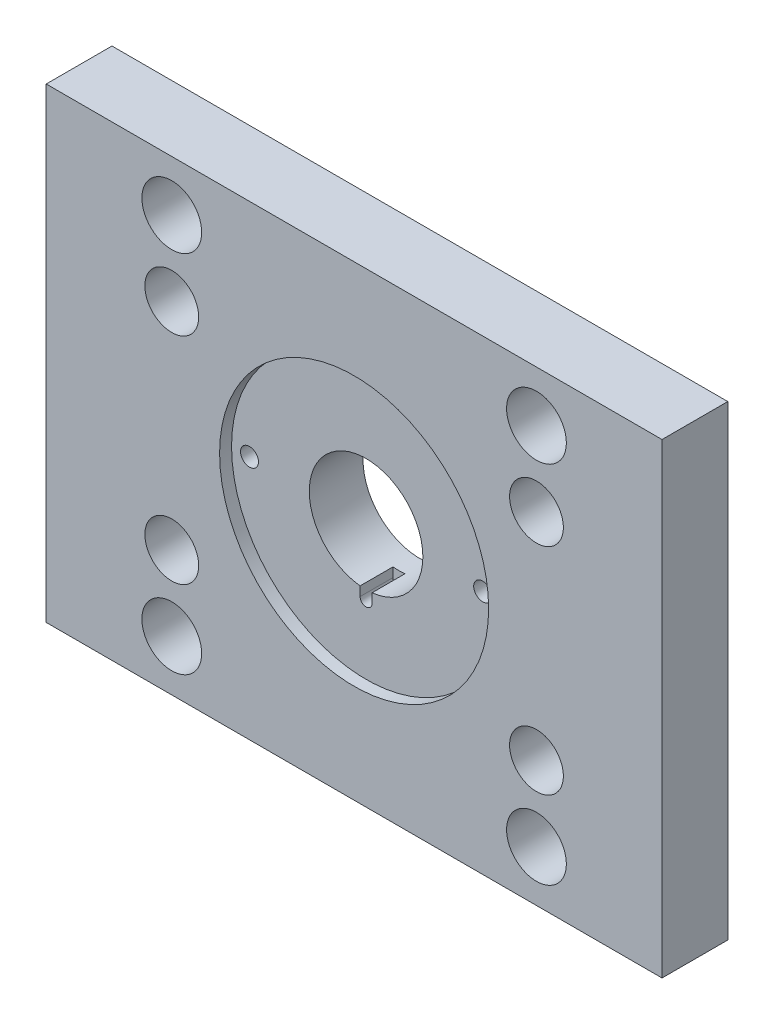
ISO-10303-21;
HEADER;
FILE_DESCRIPTION(('STEP AP214'),'2;1');
FILE_NAME('part.step','',(''),(''),'','','');
FILE_SCHEMA(('AUTOMOTIVE_DESIGN { 1 0 10303 214 1 1 1 1 }'));
ENDSEC;
DATA;
#1=APPLICATION_CONTEXT('core data for automotive mechanical design processes');
#2=APPLICATION_PROTOCOL_DEFINITION('international standard','automotive_design',2000,#1);
#3=PRODUCT_CONTEXT('',#1,'mechanical');
#4=PRODUCT('Part','Part','',(#3));
#5=PRODUCT_RELATED_PRODUCT_CATEGORY('part','',(#4));
#6=PRODUCT_DEFINITION_FORMATION('','',#4);
#7=PRODUCT_DEFINITION_CONTEXT('part definition',#1,'design');
#8=PRODUCT_DEFINITION('design','',#6,#7);
#9=PRODUCT_DEFINITION_SHAPE('','',#8);
#10=(LENGTH_UNIT() NAMED_UNIT(*) SI_UNIT(.MILLI.,.METRE.));
#11=(NAMED_UNIT(*) PLANE_ANGLE_UNIT() SI_UNIT($,.RADIAN.));
#12=(NAMED_UNIT(*) SI_UNIT($,.STERADIAN.) SOLID_ANGLE_UNIT());
#13=UNCERTAINTY_MEASURE_WITH_UNIT(LENGTH_MEASURE(1.E-05),#10,'distance_accuracy_value','');
#14=(GEOMETRIC_REPRESENTATION_CONTEXT(3) GLOBAL_UNCERTAINTY_ASSIGNED_CONTEXT((#13)) GLOBAL_UNIT_ASSIGNED_CONTEXT((#10,
#11,#12)) REPRESENTATION_CONTEXT('',''));
#15=CARTESIAN_POINT('',(0.,0.,0.));
#16=DIRECTION('',(0.,0.,1.));
#17=DIRECTION('',(1.,0.,0.));
#18=AXIS2_PLACEMENT_3D('',#15,#16,#17);
#19=CARTESIAN_POINT('',(0.,0.,0.));
#20=DIRECTION('',(0.,0.,1.));
#21=DIRECTION('',(1.,0.,0.));
#22=AXIS2_PLACEMENT_3D('',#19,#20,#21);
#23=CYLINDRICAL_SURFACE('',#22,19.);
#24=CARTESIAN_POINT('',(0.,0.,18.));
#25=DIRECTION('',(0.,0.,1.));
#26=DIRECTION('',(1.,0.,0.));
#27=AXIS2_PLACEMENT_3D('',#24,#25,#26);
#28=CIRCLE('',#27,19.);
#29=CARTESIAN_POINT('',(-2.,-18.8944436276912,18.));
#30=VERTEX_POINT('',#29);
#31=CARTESIAN_POINT('',(2.,-18.8944436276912,18.));
#32=VERTEX_POINT('',#31);
#33=EDGE_CURVE('E119',#30,#32,#28,.F.);
#34=ORIENTED_EDGE('',*,*,#33,.F.);
#35=DIRECTION('',(0.,0.,1.));
#36=VECTOR('',#35,1.);
#37=CARTESIAN_POINT('',(-2.,-18.8944436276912,0.));
#38=LINE('',#37,#36);
#39=CARTESIAN_POINT('',(-2.,-18.8944436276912,7.));
#40=VERTEX_POINT('',#39);
#41=EDGE_CURVE('E129',#30,#40,#38,.F.);
#42=ORIENTED_EDGE('',*,*,#41,.T.);
#43=CARTESIAN_POINT('',(0.,0.,7.));
#44=DIRECTION('',(0.,0.,-1.));
#45=DIRECTION('',(-1.,0.,0.));
#46=AXIS2_PLACEMENT_3D('',#43,#44,#45);
#47=CIRCLE('',#46,19.);
#48=CARTESIAN_POINT('',(2.,-18.8944436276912,7.));
#49=VERTEX_POINT('',#48);
#50=EDGE_CURVE('E11',#40,#49,#47,.F.);
#51=ORIENTED_EDGE('',*,*,#50,.T.);
#52=DIRECTION('',(0.,0.,1.));
#53=VECTOR('',#52,1.);
#54=CARTESIAN_POINT('',(2.,-18.8944436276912,0.));
#55=LINE('',#54,#53);
#56=EDGE_CURVE('E107',#49,#32,#55,.T.);
#57=ORIENTED_EDGE('',*,*,#56,.T.);
#58=EDGE_LOOP('',(#34,#42,#51,#57));
#59=FACE_BOUND('',#58,.T.);
#60=CARTESIAN_POINT('',(0.,0.,0.));
#61=DIRECTION('',(0.,0.,1.));
#62=DIRECTION('',(1.,0.,0.));
#63=AXIS2_PLACEMENT_3D('',#60,#61,#62);
#64=CIRCLE('',#63,19.);
#65=CARTESIAN_POINT('',(19.,0.,0.));
#66=VERTEX_POINT('',#65);
#67=EDGE_CURVE('E150',#66,#66,#64,.T.);
#68=ORIENTED_EDGE('',*,*,#67,.F.);
#69=EDGE_LOOP('',(#68));
#70=FACE_BOUND('',#69,.T.);
#71=ADVANCED_FACE('F32',(#59,#70),#23,.F.);
#72=CARTESIAN_POINT('',(61.,-36.,0.));
#73=DIRECTION('',(0.,0.,1.));
#74=DIRECTION('',(1.,0.,0.));
#75=AXIS2_PLACEMENT_3D('',#72,#73,#74);
#76=CYLINDRICAL_SURFACE('',#75,5.);
#77=CARTESIAN_POINT('',(61.,-36.,0.));
#78=DIRECTION('',(0.,0.,1.));
#79=DIRECTION('',(1.,0.,0.));
#80=AXIS2_PLACEMENT_3D('',#77,#78,#79);
#81=CIRCLE('',#80,5.);
#82=CARTESIAN_POINT('',(66.,-36.,0.));
#83=VERTEX_POINT('',#82);
#84=EDGE_CURVE('E174',#83,#83,#81,.T.);
#85=ORIENTED_EDGE('',*,*,#84,.F.);
#86=EDGE_LOOP('',(#85));
#87=FACE_BOUND('',#86,.T.);
#88=CARTESIAN_POINT('',(61.,-36.,9.));
#89=DIRECTION('',(0.,0.,1.));
#90=DIRECTION('',(1.,0.,0.));
#91=AXIS2_PLACEMENT_3D('',#88,#89,#90);
#92=CIRCLE('',#91,5.);
#93=CARTESIAN_POINT('',(66.,-36.,9.));
#94=VERTEX_POINT('',#93);
#95=EDGE_CURVE('E159',#94,#94,#92,.F.);
#96=ORIENTED_EDGE('',*,*,#95,.F.);
#97=EDGE_LOOP('',(#96));
#98=FACE_BOUND('',#97,.T.);
#99=ADVANCED_FACE('F273',(#87,#98),#76,.F.);
#100=CARTESIAN_POINT('',(61.,36.,0.));
#101=DIRECTION('',(0.,0.,1.));
#102=DIRECTION('',(1.,0.,0.));
#103=AXIS2_PLACEMENT_3D('',#100,#101,#102);
#104=CYLINDRICAL_SURFACE('',#103,5.);
#105=CARTESIAN_POINT('',(61.,36.,0.));
#106=DIRECTION('',(0.,0.,1.));
#107=DIRECTION('',(1.,0.,0.));
#108=AXIS2_PLACEMENT_3D('',#105,#106,#107);
#109=CIRCLE('',#108,5.);
#110=CARTESIAN_POINT('',(66.,36.,0.));
#111=VERTEX_POINT('',#110);
#112=EDGE_CURVE('E177',#111,#111,#109,.T.);
#113=ORIENTED_EDGE('',*,*,#112,.F.);
#114=EDGE_LOOP('',(#113));
#115=FACE_BOUND('',#114,.T.);
#116=CARTESIAN_POINT('',(61.,36.,9.));
#117=DIRECTION('',(0.,0.,1.));
#118=DIRECTION('',(1.,0.,0.));
#119=AXIS2_PLACEMENT_3D('',#116,#117,#118);
#120=CIRCLE('',#119,5.);
#121=CARTESIAN_POINT('',(66.,36.,9.));
#122=VERTEX_POINT('',#121);
#123=EDGE_CURVE('E166',#122,#122,#120,.F.);
#124=ORIENTED_EDGE('',*,*,#123,.F.);
#125=EDGE_LOOP('',(#124));
#126=FACE_BOUND('',#125,.T.);
#127=ADVANCED_FACE('F278',(#115,#126),#104,.F.);
#128=CARTESIAN_POINT('',(-61.,-36.,0.));
#129=DIRECTION('',(0.,0.,1.));
#130=DIRECTION('',(1.,0.,0.));
#131=AXIS2_PLACEMENT_3D('',#128,#129,#130);
#132=CYLINDRICAL_SURFACE('',#131,5.);
#133=CARTESIAN_POINT('',(-61.,-36.,0.));
#134=DIRECTION('',(0.,0.,1.));
#135=DIRECTION('',(1.,0.,0.));
#136=AXIS2_PLACEMENT_3D('',#133,#134,#135);
#137=CIRCLE('',#136,5.);
#138=CARTESIAN_POINT('',(-56.,-36.,0.));
#139=VERTEX_POINT('',#138);
#140=EDGE_CURVE('E180',#139,#139,#137,.T.);
#141=ORIENTED_EDGE('',*,*,#140,.F.);
#142=EDGE_LOOP('',(#141));
#143=FACE_BOUND('',#142,.T.);
#144=CARTESIAN_POINT('',(-61.,-36.,9.));
#145=DIRECTION('',(0.,0.,1.));
#146=DIRECTION('',(1.,0.,0.));
#147=AXIS2_PLACEMENT_3D('',#144,#145,#146);
#148=CIRCLE('',#147,5.);
#149=CARTESIAN_POINT('',(-56.,-36.,9.));
#150=VERTEX_POINT('',#149);
#151=EDGE_CURVE('E173',#150,#150,#148,.F.);
#152=ORIENTED_EDGE('',*,*,#151,.F.);
#153=EDGE_LOOP('',(#152));
#154=FACE_BOUND('',#153,.T.);
#155=ADVANCED_FACE('F312',(#143,#154),#132,.F.);
#156=CARTESIAN_POINT('',(-61.,36.,0.));
#157=DIRECTION('',(0.,0.,1.));
#158=DIRECTION('',(1.,0.,0.));
#159=AXIS2_PLACEMENT_3D('',#156,#157,#158);
#160=CYLINDRICAL_SURFACE('',#159,5.);
#161=CARTESIAN_POINT('',(-61.,36.,0.));
#162=DIRECTION('',(0.,0.,1.));
#163=DIRECTION('',(1.,0.,0.));
#164=AXIS2_PLACEMENT_3D('',#161,#162,#163);
#165=CIRCLE('',#164,5.);
#166=CARTESIAN_POINT('',(-56.,36.,0.));
#167=VERTEX_POINT('',#166);
#168=EDGE_CURVE('E190',#167,#167,#165,.T.);
#169=ORIENTED_EDGE('',*,*,#168,.F.);
#170=EDGE_LOOP('',(#169));
#171=FACE_BOUND('',#170,.T.);
#172=CARTESIAN_POINT('',(-61.,36.,9.));
#173=DIRECTION('',(0.,0.,1.));
#174=DIRECTION('',(1.,0.,0.));
#175=AXIS2_PLACEMENT_3D('',#172,#173,#174);
#176=CIRCLE('',#175,5.);
#177=CARTESIAN_POINT('',(-56.,36.,9.));
#178=VERTEX_POINT('',#177);
#179=EDGE_CURVE('E189',#178,#178,#176,.F.);
#180=ORIENTED_EDGE('',*,*,#179,.F.);
#181=EDGE_LOOP('',(#180));
#182=FACE_BOUND('',#181,.T.);
#183=ADVANCED_FACE('F316',(#171,#182),#160,.F.);
#184=CARTESIAN_POINT('',(-103.,78.,22.));
#185=DIRECTION('',(1.,0.,0.));
#186=DIRECTION('',(0.,1.,0.));
#187=AXIS2_PLACEMENT_3D('',#184,#185,#186);
#188=PLANE('',#187);
#189=DIRECTION('',(0.,-1.,0.));
#190=VECTOR('',#189,1.);
#191=CARTESIAN_POINT('',(-103.,78.,0.));
#192=LINE('',#191,#190);
#193=CARTESIAN_POINT('',(-103.,78.,0.));
#194=VERTEX_POINT('',#193);
#195=CARTESIAN_POINT('',(-103.,-78.,0.));
#196=VERTEX_POINT('',#195);
#197=EDGE_CURVE('E205',#194,#196,#192,.T.);
#198=ORIENTED_EDGE('',*,*,#197,.T.);
#199=DIRECTION('',(0.,0.,-1.));
#200=VECTOR('',#199,1.);
#201=CARTESIAN_POINT('',(-103.,-78.,22.));
#202=LINE('',#201,#200);
#203=CARTESIAN_POINT('',(-103.,-78.,22.));
#204=VERTEX_POINT('',#203);
#205=EDGE_CURVE('E230',#204,#196,#202,.T.);
#206=ORIENTED_EDGE('',*,*,#205,.F.);
#207=DIRECTION('',(0.,-1.,0.));
#208=VECTOR('',#207,1.);
#209=CARTESIAN_POINT('',(-103.,78.,22.));
#210=LINE('',#209,#208);
#211=CARTESIAN_POINT('',(-103.,78.,22.));
#212=VERTEX_POINT('',#211);
#213=EDGE_CURVE('E214',#212,#204,#210,.T.);
#214=ORIENTED_EDGE('',*,*,#213,.F.);
#215=DIRECTION('',(0.,0.,-1.));
#216=VECTOR('',#215,1.);
#217=CARTESIAN_POINT('',(-103.,78.,22.));
#218=LINE('',#217,#216);
#219=EDGE_CURVE('E221',#212,#194,#218,.T.);
#220=ORIENTED_EDGE('',*,*,#219,.T.);
#221=EDGE_LOOP('',(#198,#206,#214,#220));
#222=FACE_BOUND('',#221,.T.);
#223=ADVANCED_FACE('F327',(#222),#188,.F.);
#224=CARTESIAN_POINT('',(-103.,-78.,22.));
#225=DIRECTION('',(0.,1.,0.));
#226=DIRECTION('',(0.,0.,1.));
#227=AXIS2_PLACEMENT_3D('',#224,#225,#226);
#228=PLANE('',#227);
#229=DIRECTION('',(1.,0.,0.));
#230=VECTOR('',#229,1.);
#231=CARTESIAN_POINT('',(-103.,-78.,0.));
#232=LINE('',#231,#230);
#233=CARTESIAN_POINT('',(103.,-78.,0.));
#234=VERTEX_POINT('',#233);
#235=EDGE_CURVE('E208',#196,#234,#232,.T.);
#236=ORIENTED_EDGE('',*,*,#235,.T.);
#237=DIRECTION('',(0.,0.,-1.));
#238=VECTOR('',#237,1.);
#239=CARTESIAN_POINT('',(103.,-78.,22.));
#240=LINE('',#239,#238);
#241=CARTESIAN_POINT('',(103.,-78.,22.));
#242=VERTEX_POINT('',#241);
#243=EDGE_CURVE('E227',#242,#234,#240,.T.);
#244=ORIENTED_EDGE('',*,*,#243,.F.);
#245=DIRECTION('',(1.,0.,0.));
#246=VECTOR('',#245,1.);
#247=CARTESIAN_POINT('',(-103.,-78.,22.));
#248=LINE('',#247,#246);
#249=EDGE_CURVE('E216',#204,#242,#248,.T.);
#250=ORIENTED_EDGE('',*,*,#249,.F.);
#251=ORIENTED_EDGE('',*,*,#205,.T.);
#252=EDGE_LOOP('',(#236,#244,#250,#251));
#253=FACE_BOUND('',#252,.T.);
#254=ADVANCED_FACE('F353',(#253),#228,.F.);
#255=CARTESIAN_POINT('',(103.,78.,22.));
#256=DIRECTION('',(-1.,0.,0.));
#257=DIRECTION('',(0.,-1.,0.));
#258=AXIS2_PLACEMENT_3D('',#255,#256,#257);
#259=PLANE('',#258);
#260=DIRECTION('',(0.,1.,0.));
#261=VECTOR('',#260,1.);
#262=CARTESIAN_POINT('',(103.,78.,0.));
#263=LINE('',#262,#261);
#264=CARTESIAN_POINT('',(103.,78.,0.));
#265=VERTEX_POINT('',#264);
#266=EDGE_CURVE('E210',#234,#265,#263,.T.);
#267=ORIENTED_EDGE('',*,*,#266,.T.);
#268=DIRECTION('',(0.,0.,-1.));
#269=VECTOR('',#268,1.);
#270=CARTESIAN_POINT('',(103.,78.,22.));
#271=LINE('',#270,#269);
#272=CARTESIAN_POINT('',(103.,78.,22.));
#273=VERTEX_POINT('',#272);
#274=EDGE_CURVE('E224',#273,#265,#271,.T.);
#275=ORIENTED_EDGE('',*,*,#274,.F.);
#276=DIRECTION('',(0.,1.,0.));
#277=VECTOR('',#276,1.);
#278=CARTESIAN_POINT('',(103.,78.,22.));
#279=LINE('',#278,#277);
#280=EDGE_CURVE('E218',#242,#273,#279,.T.);
#281=ORIENTED_EDGE('',*,*,#280,.F.);
#282=ORIENTED_EDGE('',*,*,#243,.T.);
#283=EDGE_LOOP('',(#267,#275,#281,#282));
#284=FACE_BOUND('',#283,.T.);
#285=ADVANCED_FACE('F349',(#284),#259,.F.);
#286=CARTESIAN_POINT('',(-103.,78.,22.));
#287=DIRECTION('',(0.,-1.,0.));
#288=DIRECTION('',(0.,0.,-1.));
#289=AXIS2_PLACEMENT_3D('',#286,#287,#288);
#290=PLANE('',#289);
#291=DIRECTION('',(-1.,0.,0.));
#292=VECTOR('',#291,1.);
#293=CARTESIAN_POINT('',(-103.,78.,0.));
#294=LINE('',#293,#292);
#295=EDGE_CURVE('E212',#265,#194,#294,.T.);
#296=ORIENTED_EDGE('',*,*,#295,.T.);
#297=ORIENTED_EDGE('',*,*,#219,.F.);
#298=DIRECTION('',(-1.,0.,0.));
#299=VECTOR('',#298,1.);
#300=CARTESIAN_POINT('',(-103.,78.,22.));
#301=LINE('',#300,#299);
#302=EDGE_CURVE('E55',#273,#212,#301,.T.);
#303=ORIENTED_EDGE('',*,*,#302,.F.);
#304=ORIENTED_EDGE('',*,*,#274,.T.);
#305=EDGE_LOOP('',(#296,#297,#303,#304));
#306=FACE_BOUND('',#305,.T.);
#307=ADVANCED_FACE('F345',(#306),#290,.F.);
#308=CARTESIAN_POINT('',(-103.,-78.,22.));
#309=DIRECTION('',(0.,0.,1.));
#310=DIRECTION('',(1.,0.,0.));
#311=AXIS2_PLACEMENT_3D('',#308,#309,#310);
#312=PLANE('',#311);
#313=CARTESIAN_POINT('',(0.,0.,22.));
#314=DIRECTION('',(0.,0.,1.));
#315=DIRECTION('',(1.,0.,0.));
#316=AXIS2_PLACEMENT_3D('',#313,#314,#315);
#317=CIRCLE('',#316,45.);
#318=CARTESIAN_POINT('',(45.,0.,22.));
#319=VERTEX_POINT('',#318);
#320=EDGE_CURVE('E144',#319,#319,#317,.T.);
#321=ORIENTED_EDGE('',*,*,#320,.F.);
#322=EDGE_LOOP('',(#321));
#323=FACE_BOUND('',#322,.T.);
#324=CARTESIAN_POINT('',(61.,-36.,22.));
#325=DIRECTION('',(0.,0.,1.));
#326=DIRECTION('',(1.,0.,0.));
#327=AXIS2_PLACEMENT_3D('',#324,#325,#326);
#328=CIRCLE('',#327,9.);
#329=CARTESIAN_POINT('',(70.,-36.,22.));
#330=VERTEX_POINT('',#329);
#331=EDGE_CURVE('E153',#330,#330,#328,.T.);
#332=ORIENTED_EDGE('',*,*,#331,.F.);
#333=EDGE_LOOP('',(#332));
#334=FACE_BOUND('',#333,.T.);
#335=CARTESIAN_POINT('',(61.,36.,22.));
#336=DIRECTION('',(0.,0.,1.));
#337=DIRECTION('',(1.,0.,0.));
#338=AXIS2_PLACEMENT_3D('',#335,#336,#337);
#339=CIRCLE('',#338,9.);
#340=CARTESIAN_POINT('',(70.,36.,22.));
#341=VERTEX_POINT('',#340);
#342=EDGE_CURVE('E160',#341,#341,#339,.T.);
#343=ORIENTED_EDGE('',*,*,#342,.F.);
#344=EDGE_LOOP('',(#343));
#345=FACE_BOUND('',#344,.T.);
#346=CARTESIAN_POINT('',(-61.,-36.,22.));
#347=DIRECTION('',(0.,0.,1.));
#348=DIRECTION('',(1.,0.,0.));
#349=AXIS2_PLACEMENT_3D('',#346,#347,#348);
#350=CIRCLE('',#349,9.);
#351=CARTESIAN_POINT('',(-52.,-36.,22.));
#352=VERTEX_POINT('',#351);
#353=EDGE_CURVE('E167',#352,#352,#350,.T.);
#354=ORIENTED_EDGE('',*,*,#353,.F.);
#355=EDGE_LOOP('',(#354));
#356=FACE_BOUND('',#355,.T.);
#357=CARTESIAN_POINT('',(-61.,36.,22.));
#358=DIRECTION('',(0.,0.,1.));
#359=DIRECTION('',(1.,0.,0.));
#360=AXIS2_PLACEMENT_3D('',#357,#358,#359);
#361=CIRCLE('',#360,9.);
#362=CARTESIAN_POINT('',(-52.,36.,22.));
#363=VERTEX_POINT('',#362);
#364=EDGE_CURVE('E183',#363,#363,#361,.T.);
#365=ORIENTED_EDGE('',*,*,#364,.F.);
#366=EDGE_LOOP('',(#365));
#367=FACE_BOUND('',#366,.T.);
#368=CARTESIAN_POINT('',(61.,61.,22.));
#369=DIRECTION('',(0.,0.,1.));
#370=DIRECTION('',(1.,0.,0.));
#371=AXIS2_PLACEMENT_3D('',#368,#369,#370);
#372=CIRCLE('',#371,10.);
#373=CARTESIAN_POINT('',(71.,61.,22.));
#374=VERTEX_POINT('',#373);
#375=EDGE_CURVE('E196',#374,#374,#372,.T.);
#376=ORIENTED_EDGE('',*,*,#375,.F.);
#377=EDGE_LOOP('',(#376));
#378=FACE_BOUND('',#377,.T.);
#379=CARTESIAN_POINT('',(-61.,61.,22.));
#380=DIRECTION('',(0.,0.,1.));
#381=DIRECTION('',(1.,0.,0.));
#382=AXIS2_PLACEMENT_3D('',#379,#380,#381);
#383=CIRCLE('',#382,10.);
#384=CARTESIAN_POINT('',(-51.,61.,22.));
#385=VERTEX_POINT('',#384);
#386=EDGE_CURVE('E199',#385,#385,#383,.T.);
#387=ORIENTED_EDGE('',*,*,#386,.F.);
#388=EDGE_LOOP('',(#387));
#389=FACE_BOUND('',#388,.T.);
#390=ORIENTED_EDGE('',*,*,#213,.T.);
#391=ORIENTED_EDGE('',*,*,#249,.T.);
#392=ORIENTED_EDGE('',*,*,#280,.T.);
#393=ORIENTED_EDGE('',*,*,#302,.T.);
#394=EDGE_LOOP('',(#390,#391,#392,#393));
#395=FACE_BOUND('',#394,.T.);
#396=CARTESIAN_POINT('',(-61.,-61.,22.));
#397=DIRECTION('',(0.,0.,1.));
#398=DIRECTION('',(1.,0.,0.));
#399=AXIS2_PLACEMENT_3D('',#396,#397,#398);
#400=CIRCLE('',#399,10.);
#401=CARTESIAN_POINT('',(-51.,-61.,22.));
#402=VERTEX_POINT('',#401);
#403=EDGE_CURVE('E236',#402,#402,#400,.T.);
#404=ORIENTED_EDGE('',*,*,#403,.F.);
#405=EDGE_LOOP('',(#404));
#406=FACE_BOUND('',#405,.T.);
#407=CARTESIAN_POINT('',(61.,-61.,22.));
#408=DIRECTION('',(0.,0.,1.));
#409=DIRECTION('',(1.,0.,0.));
#410=AXIS2_PLACEMENT_3D('',#407,#408,#409);
#411=CIRCLE('',#410,10.);
#412=CARTESIAN_POINT('',(71.,-61.,22.));
#413=VERTEX_POINT('',#412);
#414=EDGE_CURVE('E242',#413,#413,#411,.T.);
#415=ORIENTED_EDGE('',*,*,#414,.F.);
#416=EDGE_LOOP('',(#415));
#417=FACE_BOUND('',#416,.T.);
#418=ADVANCED_FACE('F341',(#323,#334,#345,#356,#367,#378,#389,#395,#406,#417),#312,.T.);
#419=CARTESIAN_POINT('',(-103.,-78.,0.));
#420=DIRECTION('',(0.,0.,1.));
#421=DIRECTION('',(1.,0.,0.));
#422=AXIS2_PLACEMENT_3D('',#419,#420,#421);
#423=PLANE('',#422);
#424=CARTESIAN_POINT('',(39.,0.,0.));
#425=DIRECTION('',(0.,0.,1.));
#426=DIRECTION('',(1.,0.,0.));
#427=AXIS2_PLACEMENT_3D('',#424,#425,#426);
#428=CIRCLE('',#427,3.);
#429=CARTESIAN_POINT('',(42.,0.,0.));
#430=VERTEX_POINT('',#429);
#431=EDGE_CURVE('E135',#430,#430,#428,.T.);
#432=ORIENTED_EDGE('',*,*,#431,.T.);
#433=EDGE_LOOP('',(#432));
#434=FACE_BOUND('',#433,.T.);
#435=CARTESIAN_POINT('',(-39.,0.,0.));
#436=DIRECTION('',(0.,0.,1.));
#437=DIRECTION('',(1.,0.,0.));
#438=AXIS2_PLACEMENT_3D('',#435,#436,#437);
#439=CIRCLE('',#438,3.);
#440=CARTESIAN_POINT('',(-36.,0.,0.));
#441=VERTEX_POINT('',#440);
#442=EDGE_CURVE('E141',#441,#441,#439,.T.);
#443=ORIENTED_EDGE('',*,*,#442,.T.);
#444=EDGE_LOOP('',(#443));
#445=FACE_BOUND('',#444,.T.);
#446=ORIENTED_EDGE('',*,*,#67,.T.);
#447=EDGE_LOOP('',(#446));
#448=FACE_BOUND('',#447,.T.);
#449=ORIENTED_EDGE('',*,*,#84,.T.);
#450=EDGE_LOOP('',(#449));
#451=FACE_BOUND('',#450,.T.);
#452=ORIENTED_EDGE('',*,*,#112,.T.);
#453=EDGE_LOOP('',(#452));
#454=FACE_BOUND('',#453,.T.);
#455=ORIENTED_EDGE('',*,*,#140,.T.);
#456=EDGE_LOOP('',(#455));
#457=FACE_BOUND('',#456,.T.);
#458=ORIENTED_EDGE('',*,*,#168,.T.);
#459=EDGE_LOOP('',(#458));
#460=FACE_BOUND('',#459,.T.);
#461=CARTESIAN_POINT('',(61.,61.,0.));
#462=DIRECTION('',(0.,0.,1.));
#463=DIRECTION('',(1.,0.,0.));
#464=AXIS2_PLACEMENT_3D('',#461,#462,#463);
#465=CIRCLE('',#464,10.);
#466=CARTESIAN_POINT('',(71.,61.,0.));
#467=VERTEX_POINT('',#466);
#468=EDGE_CURVE('E193',#467,#467,#465,.T.);
#469=ORIENTED_EDGE('',*,*,#468,.T.);
#470=EDGE_LOOP('',(#469));
#471=FACE_BOUND('',#470,.T.);
#472=CARTESIAN_POINT('',(-61.,61.,0.));
#473=DIRECTION('',(0.,0.,1.));
#474=DIRECTION('',(1.,0.,0.));
#475=AXIS2_PLACEMENT_3D('',#472,#473,#474);
#476=CIRCLE('',#475,10.);
#477=CARTESIAN_POINT('',(-51.,61.,0.));
#478=VERTEX_POINT('',#477);
#479=EDGE_CURVE('E202',#478,#478,#476,.T.);
#480=ORIENTED_EDGE('',*,*,#479,.T.);
#481=EDGE_LOOP('',(#480));
#482=FACE_BOUND('',#481,.T.);
#483=ORIENTED_EDGE('',*,*,#197,.F.);
#484=ORIENTED_EDGE('',*,*,#295,.F.);
#485=ORIENTED_EDGE('',*,*,#266,.F.);
#486=ORIENTED_EDGE('',*,*,#235,.F.);
#487=EDGE_LOOP('',(#483,#484,#485,#486));
#488=FACE_BOUND('',#487,.T.);
#489=CARTESIAN_POINT('',(-61.,-61.,0.));
#490=DIRECTION('',(0.,0.,1.));
#491=DIRECTION('',(1.,0.,0.));
#492=AXIS2_PLACEMENT_3D('',#489,#490,#491);
#493=CIRCLE('',#492,10.);
#494=CARTESIAN_POINT('',(-51.,-61.,0.));
#495=VERTEX_POINT('',#494);
#496=EDGE_CURVE('E233',#495,#495,#493,.T.);
#497=ORIENTED_EDGE('',*,*,#496,.T.);
#498=EDGE_LOOP('',(#497));
#499=FACE_BOUND('',#498,.T.);
#500=CARTESIAN_POINT('',(61.,-61.,0.));
#501=DIRECTION('',(0.,0.,1.));
#502=DIRECTION('',(1.,0.,0.));
#503=AXIS2_PLACEMENT_3D('',#500,#501,#502);
#504=CIRCLE('',#503,10.);
#505=CARTESIAN_POINT('',(71.,-61.,0.));
#506=VERTEX_POINT('',#505);
#507=EDGE_CURVE('E239',#506,#506,#504,.T.);
#508=ORIENTED_EDGE('',*,*,#507,.T.);
#509=EDGE_LOOP('',(#508));
#510=FACE_BOUND('',#509,.T.);
#511=ADVANCED_FACE('F337',(#434,#445,#448,#451,#454,#457,#460,#471,#482,#488,#499,#510),#423,.F.);
#512=CARTESIAN_POINT('',(-61.,61.,0.));
#513=DIRECTION('',(0.,0.,1.));
#514=DIRECTION('',(1.,0.,0.));
#515=AXIS2_PLACEMENT_3D('',#512,#513,#514);
#516=CYLINDRICAL_SURFACE('',#515,10.);
#517=ORIENTED_EDGE('',*,*,#479,.F.);
#518=EDGE_LOOP('',(#517));
#519=FACE_BOUND('',#518,.T.);
#520=ORIENTED_EDGE('',*,*,#386,.T.);
#521=EDGE_LOOP('',(#520));
#522=FACE_BOUND('',#521,.T.);
#523=ADVANCED_FACE('F333',(#519,#522),#516,.F.);
#524=CARTESIAN_POINT('',(61.,61.,0.));
#525=DIRECTION('',(0.,0.,1.));
#526=DIRECTION('',(1.,0.,0.));
#527=AXIS2_PLACEMENT_3D('',#524,#525,#526);
#528=CYLINDRICAL_SURFACE('',#527,10.);
#529=ORIENTED_EDGE('',*,*,#468,.F.);
#530=EDGE_LOOP('',(#529));
#531=FACE_BOUND('',#530,.T.);
#532=ORIENTED_EDGE('',*,*,#375,.T.);
#533=EDGE_LOOP('',(#532));
#534=FACE_BOUND('',#533,.T.);
#535=ADVANCED_FACE('F329',(#531,#534),#528,.F.);
#536=CARTESIAN_POINT('',(-61.,-61.,0.));
#537=DIRECTION('',(0.,0.,1.));
#538=DIRECTION('',(1.,0.,0.));
#539=AXIS2_PLACEMENT_3D('',#536,#537,#538);
#540=CYLINDRICAL_SURFACE('',#539,10.);
#541=ORIENTED_EDGE('',*,*,#496,.F.);
#542=EDGE_LOOP('',(#541));
#543=FACE_BOUND('',#542,.T.);
#544=ORIENTED_EDGE('',*,*,#403,.T.);
#545=EDGE_LOOP('',(#544));
#546=FACE_BOUND('',#545,.T.);
#547=ADVANCED_FACE('F332',(#543,#546),#540,.F.);
#548=CARTESIAN_POINT('',(61.,-61.,0.));
#549=DIRECTION('',(0.,0.,1.));
#550=DIRECTION('',(1.,0.,0.));
#551=AXIS2_PLACEMENT_3D('',#548,#549,#550);
#552=CYLINDRICAL_SURFACE('',#551,10.);
#553=ORIENTED_EDGE('',*,*,#507,.F.);
#554=EDGE_LOOP('',(#553));
#555=FACE_BOUND('',#554,.T.);
#556=ORIENTED_EDGE('',*,*,#414,.T.);
#557=EDGE_LOOP('',(#556));
#558=FACE_BOUND('',#557,.T.);
#559=ADVANCED_FACE('F34',(#555,#558),#552,.F.);
#560=CARTESIAN_POINT('',(-61.,36.,9.));
#561=DIRECTION('',(0.,0.,1.));
#562=DIRECTION('',(1.,0.,0.));
#563=AXIS2_PLACEMENT_3D('',#560,#561,#562);
#564=PLANE('',#563);
#565=CARTESIAN_POINT('',(-61.,36.,9.));
#566=DIRECTION('',(0.,0.,1.));
#567=DIRECTION('',(1.,0.,0.));
#568=AXIS2_PLACEMENT_3D('',#565,#566,#567);
#569=CIRCLE('',#568,9.);
#570=CARTESIAN_POINT('',(-52.,36.,9.));
#571=VERTEX_POINT('',#570);
#572=EDGE_CURVE('E186',#571,#571,#569,.T.);
#573=ORIENTED_EDGE('',*,*,#572,.T.);
#574=EDGE_LOOP('',(#573));
#575=FACE_BOUND('',#574,.T.);
#576=ORIENTED_EDGE('',*,*,#179,.T.);
#577=EDGE_LOOP('',(#576));
#578=FACE_BOUND('',#577,.T.);
#579=ADVANCED_FACE('F318',(#575,#578),#564,.T.);
#580=CARTESIAN_POINT('',(-61.,36.,9.));
#581=DIRECTION('',(0.,0.,1.));
#582=DIRECTION('',(1.,0.,0.));
#583=AXIS2_PLACEMENT_3D('',#580,#581,#582);
#584=CYLINDRICAL_SURFACE('',#583,9.);
#585=CARTESIAN_POINT('',(-52.,36.,9.));
#586=CARTESIAN_POINT('',(-52.,36.,9.13541666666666));
#587=CARTESIAN_POINT('',(-52.,36.,9.27083333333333));
#588=CARTESIAN_POINT('',(-52.,36.,9.54166666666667));
#589=CARTESIAN_POINT('',(-52.,36.,9.67708333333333));
#590=CARTESIAN_POINT('',(-52.,36.,9.94791666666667));
#591=CARTESIAN_POINT('',(-52.,36.,10.0833333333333));
#592=CARTESIAN_POINT('',(-52.,36.,10.3541666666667));
#593=CARTESIAN_POINT('',(-52.,36.,10.4895833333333));
#594=CARTESIAN_POINT('',(-52.,36.,10.7604166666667));
#595=CARTESIAN_POINT('',(-52.,36.,10.8958333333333));
#596=CARTESIAN_POINT('',(-52.,36.,11.1666666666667));
#597=CARTESIAN_POINT('',(-52.,36.,11.3020833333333));
#598=CARTESIAN_POINT('',(-52.,36.,11.5729166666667));
#599=CARTESIAN_POINT('',(-52.,36.,11.7083333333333));
#600=CARTESIAN_POINT('',(-52.,36.,11.9791666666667));
#601=CARTESIAN_POINT('',(-52.,36.,12.1145833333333));
#602=CARTESIAN_POINT('',(-52.,36.,12.3854166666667));
#603=CARTESIAN_POINT('',(-52.,36.,12.5208333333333));
#604=CARTESIAN_POINT('',(-52.,36.,12.7916666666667));
#605=CARTESIAN_POINT('',(-52.,36.,12.9270833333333));
#606=CARTESIAN_POINT('',(-52.,36.,13.1979166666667));
#607=CARTESIAN_POINT('',(-52.,36.,13.3333333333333));
#608=CARTESIAN_POINT('',(-52.,36.,13.6041666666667));
#609=CARTESIAN_POINT('',(-52.,36.,13.7395833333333));
#610=CARTESIAN_POINT('',(-52.,36.,14.0104166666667));
#611=CARTESIAN_POINT('',(-52.,36.,14.1458333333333));
#612=CARTESIAN_POINT('',(-52.,36.,14.4166666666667));
#613=CARTESIAN_POINT('',(-52.,36.,14.5520833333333));
#614=CARTESIAN_POINT('',(-52.,36.,14.8229166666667));
#615=CARTESIAN_POINT('',(-52.,36.,14.9583333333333));
#616=CARTESIAN_POINT('',(-52.,36.,15.2291666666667));
#617=CARTESIAN_POINT('',(-52.,36.,15.3645833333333));
#618=CARTESIAN_POINT('',(-52.,36.,15.6354166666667));
#619=CARTESIAN_POINT('',(-52.,36.,15.7708333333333));
#620=CARTESIAN_POINT('',(-52.,36.,16.0416666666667));
#621=CARTESIAN_POINT('',(-52.,36.,16.1770833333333));
#622=CARTESIAN_POINT('',(-52.,36.,16.4479166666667));
#623=CARTESIAN_POINT('',(-52.,36.,16.5833333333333));
#624=CARTESIAN_POINT('',(-52.,36.,16.8541666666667));
#625=CARTESIAN_POINT('',(-52.,36.,16.9895833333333));
#626=CARTESIAN_POINT('',(-52.,36.,17.2604166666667));
#627=CARTESIAN_POINT('',(-52.,36.,17.3958333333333));
#628=CARTESIAN_POINT('',(-52.,36.,17.6666666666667));
#629=CARTESIAN_POINT('',(-52.,36.,17.8020833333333));
#630=CARTESIAN_POINT('',(-52.,36.,18.0729166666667));
#631=CARTESIAN_POINT('',(-52.,36.,18.2083333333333));
#632=CARTESIAN_POINT('',(-52.,36.,18.4791666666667));
#633=CARTESIAN_POINT('',(-52.,36.,18.6145833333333));
#634=CARTESIAN_POINT('',(-52.,36.,18.8854166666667));
#635=CARTESIAN_POINT('',(-52.,36.,19.0208333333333));
#636=CARTESIAN_POINT('',(-52.,36.,19.2916666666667));
#637=CARTESIAN_POINT('',(-52.,36.,19.4270833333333));
#638=CARTESIAN_POINT('',(-52.,36.,19.6979166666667));
#639=CARTESIAN_POINT('',(-52.,36.,19.8333333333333));
#640=CARTESIAN_POINT('',(-52.,36.,20.1041666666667));
#641=CARTESIAN_POINT('',(-52.,36.,20.2395833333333));
#642=CARTESIAN_POINT('',(-52.,36.,20.5104166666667));
#643=CARTESIAN_POINT('',(-52.,36.,20.6458333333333));
#644=CARTESIAN_POINT('',(-52.,36.,20.9166666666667));
#645=CARTESIAN_POINT('',(-52.,36.,21.0520833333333));
#646=CARTESIAN_POINT('',(-52.,36.,21.3229166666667));
#647=CARTESIAN_POINT('',(-52.,36.,21.4583333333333));
#648=CARTESIAN_POINT('',(-52.,36.,21.7291666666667));
#649=CARTESIAN_POINT('',(-52.,36.,21.8645833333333));
#650=CARTESIAN_POINT('',(-52.,36.,22.));
#651=B_SPLINE_CURVE_WITH_KNOTS('',3,(#585,#586,#587,#588,#589,#590,#591,#592,#593,#594,#595,
#596,#597,#598,#599,#600,#601,#602,#603,#604,#605,#606,#607,#608,#609,#610,#611,#612,#613,#614,
#615,#616,#617,#618,#619,#620,#621,#622,#623,#624,#625,#626,#627,#628,#629,#630,#631,#632,#633,
#634,#635,#636,#637,#638,#639,#640,#641,#642,#643,#644,#645,#646,#647,#648,#649,#650),
.UNSPECIFIED.,.F.,.F.,(4,2,2,2,2,2,2,2,2,2,2,2,2,2,2,2,2,2,2,2,2,2,2,2,2,2,2,2,2,2,2,2,4),(0.,
0.406249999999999,0.812499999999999,1.21875,1.625,2.03125,2.4375,2.84375,3.25,3.65625,4.0625,
4.46875,4.875,5.28125,5.6875,6.09375,6.5,6.90625,7.3125,7.71875,8.12499999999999,8.53125,8.9375,
9.34375,9.75,10.15625,10.5625,10.96875,11.375,11.78125,12.1875,12.59375,13.),.UNSPECIFIED.);
#652=EDGE_CURVE('BSEAM305',#571,#363,#651,.T.);
#653=ORIENTED_EDGE('',*,*,#572,.F.);
#654=ORIENTED_EDGE('',*,*,#364,.T.);
#655=ORIENTED_EDGE('',*,*,#652,.T.);
#656=ORIENTED_EDGE('',*,*,#652,.F.);
#657=EDGE_LOOP('',(#653,#655,#654,#656));
#658=FACE_BOUND('',#657,.T.);
#659=ADVANCED_FACE('F305',(#658),#584,.F.);
#660=CARTESIAN_POINT('',(-61.,-36.,9.));
#661=DIRECTION('',(0.,0.,1.));
#662=DIRECTION('',(1.,0.,0.));
#663=AXIS2_PLACEMENT_3D('',#660,#661,#662);
#664=PLANE('',#663);
#665=CARTESIAN_POINT('',(-61.,-36.,9.));
#666=DIRECTION('',(0.,0.,1.));
#667=DIRECTION('',(1.,0.,0.));
#668=AXIS2_PLACEMENT_3D('',#665,#666,#667);
#669=CIRCLE('',#668,9.);
#670=CARTESIAN_POINT('',(-52.,-36.,9.));
#671=VERTEX_POINT('',#670);
#672=EDGE_CURVE('E170',#671,#671,#669,.T.);
#673=ORIENTED_EDGE('',*,*,#672,.T.);
#674=EDGE_LOOP('',(#673));
#675=FACE_BOUND('',#674,.T.);
#676=ORIENTED_EDGE('',*,*,#151,.T.);
#677=EDGE_LOOP('',(#676));
#678=FACE_BOUND('',#677,.T.);
#679=ADVANCED_FACE('F302',(#675,#678),#664,.T.);
#680=CARTESIAN_POINT('',(-61.,-36.,9.));
#681=DIRECTION('',(0.,0.,1.));
#682=DIRECTION('',(1.,0.,0.));
#683=AXIS2_PLACEMENT_3D('',#680,#681,#682);
#684=CYLINDRICAL_SURFACE('',#683,9.);
#685=CARTESIAN_POINT('',(-52.,-36.,9.));
#686=CARTESIAN_POINT('',(-52.,-36.,9.13541666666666));
#687=CARTESIAN_POINT('',(-52.,-36.,9.27083333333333));
#688=CARTESIAN_POINT('',(-52.,-36.,9.54166666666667));
#689=CARTESIAN_POINT('',(-52.,-36.,9.67708333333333));
#690=CARTESIAN_POINT('',(-52.,-36.,9.94791666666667));
#691=CARTESIAN_POINT('',(-52.,-36.,10.0833333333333));
#692=CARTESIAN_POINT('',(-52.,-36.,10.3541666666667));
#693=CARTESIAN_POINT('',(-52.,-36.,10.4895833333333));
#694=CARTESIAN_POINT('',(-52.,-36.,10.7604166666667));
#695=CARTESIAN_POINT('',(-52.,-36.,10.8958333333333));
#696=CARTESIAN_POINT('',(-52.,-36.,11.1666666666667));
#697=CARTESIAN_POINT('',(-52.,-36.,11.3020833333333));
#698=CARTESIAN_POINT('',(-52.,-36.,11.5729166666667));
#699=CARTESIAN_POINT('',(-52.,-36.,11.7083333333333));
#700=CARTESIAN_POINT('',(-52.,-36.,11.9791666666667));
#701=CARTESIAN_POINT('',(-52.,-36.,12.1145833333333));
#702=CARTESIAN_POINT('',(-52.,-36.,12.3854166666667));
#703=CARTESIAN_POINT('',(-52.,-36.,12.5208333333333));
#704=CARTESIAN_POINT('',(-52.,-36.,12.7916666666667));
#705=CARTESIAN_POINT('',(-52.,-36.,12.9270833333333));
#706=CARTESIAN_POINT('',(-52.,-36.,13.1979166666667));
#707=CARTESIAN_POINT('',(-52.,-36.,13.3333333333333));
#708=CARTESIAN_POINT('',(-52.,-36.,13.6041666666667));
#709=CARTESIAN_POINT('',(-52.,-36.,13.7395833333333));
#710=CARTESIAN_POINT('',(-52.,-36.,14.0104166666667));
#711=CARTESIAN_POINT('',(-52.,-36.,14.1458333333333));
#712=CARTESIAN_POINT('',(-52.,-36.,14.4166666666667));
#713=CARTESIAN_POINT('',(-52.,-36.,14.5520833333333));
#714=CARTESIAN_POINT('',(-52.,-36.,14.8229166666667));
#715=CARTESIAN_POINT('',(-52.,-36.,14.9583333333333));
#716=CARTESIAN_POINT('',(-52.,-36.,15.2291666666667));
#717=CARTESIAN_POINT('',(-52.,-36.,15.3645833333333));
#718=CARTESIAN_POINT('',(-52.,-36.,15.6354166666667));
#719=CARTESIAN_POINT('',(-52.,-36.,15.7708333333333));
#720=CARTESIAN_POINT('',(-52.,-36.,16.0416666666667));
#721=CARTESIAN_POINT('',(-52.,-36.,16.1770833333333));
#722=CARTESIAN_POINT('',(-52.,-36.,16.4479166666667));
#723=CARTESIAN_POINT('',(-52.,-36.,16.5833333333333));
#724=CARTESIAN_POINT('',(-52.,-36.,16.8541666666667));
#725=CARTESIAN_POINT('',(-52.,-36.,16.9895833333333));
#726=CARTESIAN_POINT('',(-52.,-36.,17.2604166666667));
#727=CARTESIAN_POINT('',(-52.,-36.,17.3958333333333));
#728=CARTESIAN_POINT('',(-52.,-36.,17.6666666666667));
#729=CARTESIAN_POINT('',(-52.,-36.,17.8020833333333));
#730=CARTESIAN_POINT('',(-52.,-36.,18.0729166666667));
#731=CARTESIAN_POINT('',(-52.,-36.,18.2083333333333));
#732=CARTESIAN_POINT('',(-52.,-36.,18.4791666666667));
#733=CARTESIAN_POINT('',(-52.,-36.,18.6145833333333));
#734=CARTESIAN_POINT('',(-52.,-36.,18.8854166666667));
#735=CARTESIAN_POINT('',(-52.,-36.,19.0208333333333));
#736=CARTESIAN_POINT('',(-52.,-36.,19.2916666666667));
#737=CARTESIAN_POINT('',(-52.,-36.,19.4270833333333));
#738=CARTESIAN_POINT('',(-52.,-36.,19.6979166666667));
#739=CARTESIAN_POINT('',(-52.,-36.,19.8333333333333));
#740=CARTESIAN_POINT('',(-52.,-36.,20.1041666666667));
#741=CARTESIAN_POINT('',(-52.,-36.,20.2395833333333));
#742=CARTESIAN_POINT('',(-52.,-36.,20.5104166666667));
#743=CARTESIAN_POINT('',(-52.,-36.,20.6458333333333));
#744=CARTESIAN_POINT('',(-52.,-36.,20.9166666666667));
#745=CARTESIAN_POINT('',(-52.,-36.,21.0520833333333));
#746=CARTESIAN_POINT('',(-52.,-36.,21.3229166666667));
#747=CARTESIAN_POINT('',(-52.,-36.,21.4583333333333));
#748=CARTESIAN_POINT('',(-52.,-36.,21.7291666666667));
#749=CARTESIAN_POINT('',(-52.,-36.,21.8645833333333));
#750=CARTESIAN_POINT('',(-52.,-36.,22.));
#751=B_SPLINE_CURVE_WITH_KNOTS('',3,(#685,#686,#687,#688,#689,#690,#691,#692,#693,#694,#695,
#696,#697,#698,#699,#700,#701,#702,#703,#704,#705,#706,#707,#708,#709,#710,#711,#712,#713,#714,
#715,#716,#717,#718,#719,#720,#721,#722,#723,#724,#725,#726,#727,#728,#729,#730,#731,#732,#733,
#734,#735,#736,#737,#738,#739,#740,#741,#742,#743,#744,#745,#746,#747,#748,#749,#750),
.UNSPECIFIED.,.F.,.F.,(4,2,2,2,2,2,2,2,2,2,2,2,2,2,2,2,2,2,2,2,2,2,2,2,2,2,2,2,2,2,2,2,4),(0.,
0.406249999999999,0.812499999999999,1.21875,1.625,2.03125,2.4375,2.84375,3.25,3.65625,4.0625,
4.46875,4.875,5.28125,5.6875,6.09375,6.5,6.90625,7.3125,7.71875,8.12499999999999,8.53125,8.9375,
9.34375,9.75,10.15625,10.5625,10.96875,11.375,11.78125,12.1875,12.59375,13.),.UNSPECIFIED.);
#752=EDGE_CURVE('BSEAM297',#671,#352,#751,.T.);
#753=ORIENTED_EDGE('',*,*,#672,.F.);
#754=ORIENTED_EDGE('',*,*,#353,.T.);
#755=ORIENTED_EDGE('',*,*,#752,.T.);
#756=ORIENTED_EDGE('',*,*,#752,.F.);
#757=EDGE_LOOP('',(#753,#755,#754,#756));
#758=FACE_BOUND('',#757,.T.);
#759=ADVANCED_FACE('F297',(#758),#684,.F.);
#760=CARTESIAN_POINT('',(61.,36.,9.));
#761=DIRECTION('',(0.,0.,1.));
#762=DIRECTION('',(1.,0.,0.));
#763=AXIS2_PLACEMENT_3D('',#760,#761,#762);
#764=PLANE('',#763);
#765=CARTESIAN_POINT('',(61.,36.,9.));
#766=DIRECTION('',(0.,0.,1.));
#767=DIRECTION('',(1.,0.,0.));
#768=AXIS2_PLACEMENT_3D('',#765,#766,#767);
#769=CIRCLE('',#768,9.);
#770=CARTESIAN_POINT('',(70.,36.,9.));
#771=VERTEX_POINT('',#770);
#772=EDGE_CURVE('E163',#771,#771,#769,.T.);
#773=ORIENTED_EDGE('',*,*,#772,.T.);
#774=EDGE_LOOP('',(#773));
#775=FACE_BOUND('',#774,.T.);
#776=ORIENTED_EDGE('',*,*,#123,.T.);
#777=EDGE_LOOP('',(#776));
#778=FACE_BOUND('',#777,.T.);
#779=ADVANCED_FACE('F294',(#775,#778),#764,.T.);
#780=CARTESIAN_POINT('',(61.,36.,9.));
#781=DIRECTION('',(0.,0.,1.));
#782=DIRECTION('',(1.,0.,0.));
#783=AXIS2_PLACEMENT_3D('',#780,#781,#782);
#784=CYLINDRICAL_SURFACE('',#783,9.);
#785=CARTESIAN_POINT('',(70.,36.,9.));
#786=CARTESIAN_POINT('',(70.,36.,9.13541666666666));
#787=CARTESIAN_POINT('',(70.,36.,9.27083333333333));
#788=CARTESIAN_POINT('',(70.,36.,9.54166666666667));
#789=CARTESIAN_POINT('',(70.,36.,9.67708333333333));
#790=CARTESIAN_POINT('',(70.,36.,9.94791666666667));
#791=CARTESIAN_POINT('',(70.,36.,10.0833333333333));
#792=CARTESIAN_POINT('',(70.,36.,10.3541666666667));
#793=CARTESIAN_POINT('',(70.,36.,10.4895833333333));
#794=CARTESIAN_POINT('',(70.,36.,10.7604166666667));
#795=CARTESIAN_POINT('',(70.,36.,10.8958333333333));
#796=CARTESIAN_POINT('',(70.,36.,11.1666666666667));
#797=CARTESIAN_POINT('',(70.,36.,11.3020833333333));
#798=CARTESIAN_POINT('',(70.,36.,11.5729166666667));
#799=CARTESIAN_POINT('',(70.,36.,11.7083333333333));
#800=CARTESIAN_POINT('',(70.,36.,11.9791666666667));
#801=CARTESIAN_POINT('',(70.,36.,12.1145833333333));
#802=CARTESIAN_POINT('',(70.,36.,12.3854166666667));
#803=CARTESIAN_POINT('',(70.,36.,12.5208333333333));
#804=CARTESIAN_POINT('',(70.,36.,12.7916666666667));
#805=CARTESIAN_POINT('',(70.,36.,12.9270833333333));
#806=CARTESIAN_POINT('',(70.,36.,13.1979166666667));
#807=CARTESIAN_POINT('',(70.,36.,13.3333333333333));
#808=CARTESIAN_POINT('',(70.,36.,13.6041666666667));
#809=CARTESIAN_POINT('',(70.,36.,13.7395833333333));
#810=CARTESIAN_POINT('',(70.,36.,14.0104166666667));
#811=CARTESIAN_POINT('',(70.,36.,14.1458333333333));
#812=CARTESIAN_POINT('',(70.,36.,14.4166666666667));
#813=CARTESIAN_POINT('',(70.,36.,14.5520833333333));
#814=CARTESIAN_POINT('',(70.,36.,14.8229166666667));
#815=CARTESIAN_POINT('',(70.,36.,14.9583333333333));
#816=CARTESIAN_POINT('',(70.,36.,15.2291666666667));
#817=CARTESIAN_POINT('',(70.,36.,15.3645833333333));
#818=CARTESIAN_POINT('',(70.,36.,15.6354166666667));
#819=CARTESIAN_POINT('',(70.,36.,15.7708333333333));
#820=CARTESIAN_POINT('',(70.,36.,16.0416666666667));
#821=CARTESIAN_POINT('',(70.,36.,16.1770833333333));
#822=CARTESIAN_POINT('',(70.,36.,16.4479166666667));
#823=CARTESIAN_POINT('',(70.,36.,16.5833333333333));
#824=CARTESIAN_POINT('',(70.,36.,16.8541666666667));
#825=CARTESIAN_POINT('',(70.,36.,16.9895833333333));
#826=CARTESIAN_POINT('',(70.,36.,17.2604166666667));
#827=CARTESIAN_POINT('',(70.,36.,17.3958333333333));
#828=CARTESIAN_POINT('',(70.,36.,17.6666666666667));
#829=CARTESIAN_POINT('',(70.,36.,17.8020833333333));
#830=CARTESIAN_POINT('',(70.,36.,18.0729166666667));
#831=CARTESIAN_POINT('',(70.,36.,18.2083333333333));
#832=CARTESIAN_POINT('',(70.,36.,18.4791666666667));
#833=CARTESIAN_POINT('',(70.,36.,18.6145833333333));
#834=CARTESIAN_POINT('',(70.,36.,18.8854166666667));
#835=CARTESIAN_POINT('',(70.,36.,19.0208333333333));
#836=CARTESIAN_POINT('',(70.,36.,19.2916666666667));
#837=CARTESIAN_POINT('',(70.,36.,19.4270833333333));
#838=CARTESIAN_POINT('',(70.,36.,19.6979166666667));
#839=CARTESIAN_POINT('',(70.,36.,19.8333333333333));
#840=CARTESIAN_POINT('',(70.,36.,20.1041666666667));
#841=CARTESIAN_POINT('',(70.,36.,20.2395833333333));
#842=CARTESIAN_POINT('',(70.,36.,20.5104166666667));
#843=CARTESIAN_POINT('',(70.,36.,20.6458333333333));
#844=CARTESIAN_POINT('',(70.,36.,20.9166666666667));
#845=CARTESIAN_POINT('',(70.,36.,21.0520833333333));
#846=CARTESIAN_POINT('',(70.,36.,21.3229166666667));
#847=CARTESIAN_POINT('',(70.,36.,21.4583333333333));
#848=CARTESIAN_POINT('',(70.,36.,21.7291666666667));
#849=CARTESIAN_POINT('',(70.,36.,21.8645833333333));
#850=CARTESIAN_POINT('',(70.,36.,22.));
#851=B_SPLINE_CURVE_WITH_KNOTS('',3,(#785,#786,#787,#788,#789,#790,#791,#792,#793,#794,#795,
#796,#797,#798,#799,#800,#801,#802,#803,#804,#805,#806,#807,#808,#809,#810,#811,#812,#813,#814,
#815,#816,#817,#818,#819,#820,#821,#822,#823,#824,#825,#826,#827,#828,#829,#830,#831,#832,#833,
#834,#835,#836,#837,#838,#839,#840,#841,#842,#843,#844,#845,#846,#847,#848,#849,#850),
.UNSPECIFIED.,.F.,.F.,(4,2,2,2,2,2,2,2,2,2,2,2,2,2,2,2,2,2,2,2,2,2,2,2,2,2,2,2,2,2,2,2,4),(0.,
0.406249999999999,0.812499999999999,1.21875,1.625,2.03125,2.4375,2.84375,3.25,3.65625,4.0625,
4.46875,4.875,5.28125,5.6875,6.09375,6.5,6.90625,7.3125,7.71875,8.12499999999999,8.53125,8.9375,
9.34375,9.75,10.15625,10.5625,10.96875,11.375,11.78125,12.1875,12.59375,13.),.UNSPECIFIED.);
#852=EDGE_CURVE('BSEAM289',#771,#341,#851,.T.);
#853=ORIENTED_EDGE('',*,*,#772,.F.);
#854=ORIENTED_EDGE('',*,*,#342,.T.);
#855=ORIENTED_EDGE('',*,*,#852,.T.);
#856=ORIENTED_EDGE('',*,*,#852,.F.);
#857=EDGE_LOOP('',(#853,#855,#854,#856));
#858=FACE_BOUND('',#857,.T.);
#859=ADVANCED_FACE('F289',(#858),#784,.F.);
#860=CARTESIAN_POINT('',(61.,-36.,9.));
#861=DIRECTION('',(0.,0.,1.));
#862=DIRECTION('',(1.,0.,0.));
#863=AXIS2_PLACEMENT_3D('',#860,#861,#862);
#864=PLANE('',#863);
#865=CARTESIAN_POINT('',(61.,-36.,9.));
#866=DIRECTION('',(0.,0.,1.));
#867=DIRECTION('',(1.,0.,0.));
#868=AXIS2_PLACEMENT_3D('',#865,#866,#867);
#869=CIRCLE('',#868,9.);
#870=CARTESIAN_POINT('',(70.,-36.,9.));
#871=VERTEX_POINT('',#870);
#872=EDGE_CURVE('E156',#871,#871,#869,.T.);
#873=ORIENTED_EDGE('',*,*,#872,.T.);
#874=EDGE_LOOP('',(#873));
#875=FACE_BOUND('',#874,.T.);
#876=ORIENTED_EDGE('',*,*,#95,.T.);
#877=EDGE_LOOP('',(#876));
#878=FACE_BOUND('',#877,.T.);
#879=ADVANCED_FACE('F285',(#875,#878),#864,.T.);
#880=CARTESIAN_POINT('',(61.,-36.,9.));
#881=DIRECTION('',(0.,0.,1.));
#882=DIRECTION('',(1.,0.,0.));
#883=AXIS2_PLACEMENT_3D('',#880,#881,#882);
#884=CYLINDRICAL_SURFACE('',#883,9.);
#885=CARTESIAN_POINT('',(70.,-36.,9.));
#886=CARTESIAN_POINT('',(70.,-36.,9.13541666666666));
#887=CARTESIAN_POINT('',(70.,-36.,9.27083333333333));
#888=CARTESIAN_POINT('',(70.,-36.,9.54166666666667));
#889=CARTESIAN_POINT('',(70.,-36.,9.67708333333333));
#890=CARTESIAN_POINT('',(70.,-36.,9.94791666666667));
#891=CARTESIAN_POINT('',(70.,-36.,10.0833333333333));
#892=CARTESIAN_POINT('',(70.,-36.,10.3541666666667));
#893=CARTESIAN_POINT('',(70.,-36.,10.4895833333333));
#894=CARTESIAN_POINT('',(70.,-36.,10.7604166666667));
#895=CARTESIAN_POINT('',(70.,-36.,10.8958333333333));
#896=CARTESIAN_POINT('',(70.,-36.,11.1666666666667));
#897=CARTESIAN_POINT('',(70.,-36.,11.3020833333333));
#898=CARTESIAN_POINT('',(70.,-36.,11.5729166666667));
#899=CARTESIAN_POINT('',(70.,-36.,11.7083333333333));
#900=CARTESIAN_POINT('',(70.,-36.,11.9791666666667));
#901=CARTESIAN_POINT('',(70.,-36.,12.1145833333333));
#902=CARTESIAN_POINT('',(70.,-36.,12.3854166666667));
#903=CARTESIAN_POINT('',(70.,-36.,12.5208333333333));
#904=CARTESIAN_POINT('',(70.,-36.,12.7916666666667));
#905=CARTESIAN_POINT('',(70.,-36.,12.9270833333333));
#906=CARTESIAN_POINT('',(70.,-36.,13.1979166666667));
#907=CARTESIAN_POINT('',(70.,-36.,13.3333333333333));
#908=CARTESIAN_POINT('',(70.,-36.,13.6041666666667));
#909=CARTESIAN_POINT('',(70.,-36.,13.7395833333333));
#910=CARTESIAN_POINT('',(70.,-36.,14.0104166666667));
#911=CARTESIAN_POINT('',(70.,-36.,14.1458333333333));
#912=CARTESIAN_POINT('',(70.,-36.,14.4166666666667));
#913=CARTESIAN_POINT('',(70.,-36.,14.5520833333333));
#914=CARTESIAN_POINT('',(70.,-36.,14.8229166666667));
#915=CARTESIAN_POINT('',(70.,-36.,14.9583333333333));
#916=CARTESIAN_POINT('',(70.,-36.,15.2291666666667));
#917=CARTESIAN_POINT('',(70.,-36.,15.3645833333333));
#918=CARTESIAN_POINT('',(70.,-36.,15.6354166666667));
#919=CARTESIAN_POINT('',(70.,-36.,15.7708333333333));
#920=CARTESIAN_POINT('',(70.,-36.,16.0416666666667));
#921=CARTESIAN_POINT('',(70.,-36.,16.1770833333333));
#922=CARTESIAN_POINT('',(70.,-36.,16.4479166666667));
#923=CARTESIAN_POINT('',(70.,-36.,16.5833333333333));
#924=CARTESIAN_POINT('',(70.,-36.,16.8541666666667));
#925=CARTESIAN_POINT('',(70.,-36.,16.9895833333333));
#926=CARTESIAN_POINT('',(70.,-36.,17.2604166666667));
#927=CARTESIAN_POINT('',(70.,-36.,17.3958333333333));
#928=CARTESIAN_POINT('',(70.,-36.,17.6666666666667));
#929=CARTESIAN_POINT('',(70.,-36.,17.8020833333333));
#930=CARTESIAN_POINT('',(70.,-36.,18.0729166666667));
#931=CARTESIAN_POINT('',(70.,-36.,18.2083333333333));
#932=CARTESIAN_POINT('',(70.,-36.,18.4791666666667));
#933=CARTESIAN_POINT('',(70.,-36.,18.6145833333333));
#934=CARTESIAN_POINT('',(70.,-36.,18.8854166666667));
#935=CARTESIAN_POINT('',(70.,-36.,19.0208333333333));
#936=CARTESIAN_POINT('',(70.,-36.,19.2916666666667));
#937=CARTESIAN_POINT('',(70.,-36.,19.4270833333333));
#938=CARTESIAN_POINT('',(70.,-36.,19.6979166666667));
#939=CARTESIAN_POINT('',(70.,-36.,19.8333333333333));
#940=CARTESIAN_POINT('',(70.,-36.,20.1041666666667));
#941=CARTESIAN_POINT('',(70.,-36.,20.2395833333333));
#942=CARTESIAN_POINT('',(70.,-36.,20.5104166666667));
#943=CARTESIAN_POINT('',(70.,-36.,20.6458333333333));
#944=CARTESIAN_POINT('',(70.,-36.,20.9166666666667));
#945=CARTESIAN_POINT('',(70.,-36.,21.0520833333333));
#946=CARTESIAN_POINT('',(70.,-36.,21.3229166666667));
#947=CARTESIAN_POINT('',(70.,-36.,21.4583333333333));
#948=CARTESIAN_POINT('',(70.,-36.,21.7291666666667));
#949=CARTESIAN_POINT('',(70.,-36.,21.8645833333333));
#950=CARTESIAN_POINT('',(70.,-36.,22.));
#951=B_SPLINE_CURVE_WITH_KNOTS('',3,(#885,#886,#887,#888,#889,#890,#891,#892,#893,#894,#895,
#896,#897,#898,#899,#900,#901,#902,#903,#904,#905,#906,#907,#908,#909,#910,#911,#912,#913,#914,
#915,#916,#917,#918,#919,#920,#921,#922,#923,#924,#925,#926,#927,#928,#929,#930,#931,#932,#933,
#934,#935,#936,#937,#938,#939,#940,#941,#942,#943,#944,#945,#946,#947,#948,#949,#950),
.UNSPECIFIED.,.F.,.F.,(4,2,2,2,2,2,2,2,2,2,2,2,2,2,2,2,2,2,2,2,2,2,2,2,2,2,2,2,2,2,2,2,4),(0.,
0.406249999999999,0.812499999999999,1.21875,1.625,2.03125,2.4375,2.84375,3.25,3.65625,4.0625,
4.46875,4.875,5.28125,5.6875,6.09375,6.5,6.90625,7.3125,7.71875,8.12499999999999,8.53125,8.9375,
9.34375,9.75,10.15625,10.5625,10.96875,11.375,11.78125,12.1875,12.59375,13.),.UNSPECIFIED.);
#952=EDGE_CURVE('BSEAM288',#871,#330,#951,.T.);
#953=ORIENTED_EDGE('',*,*,#872,.F.);
#954=ORIENTED_EDGE('',*,*,#331,.T.);
#955=ORIENTED_EDGE('',*,*,#952,.T.);
#956=ORIENTED_EDGE('',*,*,#952,.F.);
#957=EDGE_LOOP('',(#953,#955,#954,#956));
#958=FACE_BOUND('',#957,.T.);
#959=ADVANCED_FACE('F288',(#958),#884,.F.);
#960=CARTESIAN_POINT('',(0.,0.,18.));
#961=DIRECTION('',(0.,0.,1.));
#962=DIRECTION('',(1.,0.,0.));
#963=AXIS2_PLACEMENT_3D('',#960,#961,#962);
#964=PLANE('',#963);
#965=DIRECTION('',(0.,-1.,0.));
#966=VECTOR('',#965,1.);
#967=CARTESIAN_POINT('',(-2.,0.,18.));
#968=LINE('',#967,#966);
#969=CARTESIAN_POINT('',(-2.,-22.,18.));
#970=VERTEX_POINT('',#969);
#971=EDGE_CURVE('E40',#30,#970,#968,.T.);
#972=ORIENTED_EDGE('',*,*,#971,.F.);
#973=ORIENTED_EDGE('',*,*,#33,.T.);
#974=DIRECTION('',(0.,1.,0.));
#975=VECTOR('',#974,1.);
#976=CARTESIAN_POINT('',(2.,-18.,18.));
#977=LINE('',#976,#975);
#978=CARTESIAN_POINT('',(2.,-22.,18.));
#979=VERTEX_POINT('',#978);
#980=EDGE_CURVE('E102',#979,#32,#977,.T.);
#981=ORIENTED_EDGE('',*,*,#980,.F.);
#982=CARTESIAN_POINT('',(0.,-22.,18.));
#983=DIRECTION('',(0.,0.,1.));
#984=DIRECTION('',(-1.,0.,0.));
#985=AXIS2_PLACEMENT_3D('',#982,#983,#984);
#986=CIRCLE('',#985,2.);
#987=EDGE_CURVE('E110',#970,#979,#986,.T.);
#988=ORIENTED_EDGE('',*,*,#987,.F.);
#989=EDGE_LOOP('',(#972,#973,#981,#988));
#990=FACE_BOUND('',#989,.T.);
#991=CARTESIAN_POINT('',(39.,0.,18.));
#992=DIRECTION('',(0.,0.,1.));
#993=DIRECTION('',(1.,0.,0.));
#994=AXIS2_PLACEMENT_3D('',#991,#992,#993);
#995=CIRCLE('',#994,3.);
#996=CARTESIAN_POINT('',(42.,0.,18.));
#997=VERTEX_POINT('',#996);
#998=EDGE_CURVE('E132',#997,#997,#995,.T.);
#999=ORIENTED_EDGE('',*,*,#998,.F.);
#1000=EDGE_LOOP('',(#999));
#1001=FACE_BOUND('',#1000,.T.);
#1002=CARTESIAN_POINT('',(-39.,0.,18.));
#1003=DIRECTION('',(0.,0.,1.));
#1004=DIRECTION('',(1.,0.,0.));
#1005=AXIS2_PLACEMENT_3D('',#1002,#1003,#1004);
#1006=CIRCLE('',#1005,3.);
#1007=CARTESIAN_POINT('',(-36.,0.,18.));
#1008=VERTEX_POINT('',#1007);
#1009=EDGE_CURVE('E138',#1008,#1008,#1006,.T.);
#1010=ORIENTED_EDGE('',*,*,#1009,.F.);
#1011=EDGE_LOOP('',(#1010));
#1012=FACE_BOUND('',#1011,.T.);
#1013=CARTESIAN_POINT('',(0.,0.,18.));
#1014=DIRECTION('',(0.,0.,1.));
#1015=DIRECTION('',(1.,0.,0.));
#1016=AXIS2_PLACEMENT_3D('',#1013,#1014,#1015);
#1017=CIRCLE('',#1016,45.);
#1018=CARTESIAN_POINT('',(45.,0.,18.));
#1019=VERTEX_POINT('',#1018);
#1020=EDGE_CURVE('E147',#1019,#1019,#1017,.T.);
#1021=ORIENTED_EDGE('',*,*,#1020,.T.);
#1022=EDGE_LOOP('',(#1021));
#1023=FACE_BOUND('',#1022,.T.);
#1024=ADVANCED_FACE('F116',(#990,#1001,#1012,#1023),#964,.T.);
#1025=CARTESIAN_POINT('',(0.,0.,18.));
#1026=DIRECTION('',(0.,0.,1.));
#1027=DIRECTION('',(1.,0.,0.));
#1028=AXIS2_PLACEMENT_3D('',#1025,#1026,#1027);
#1029=CYLINDRICAL_SURFACE('',#1028,45.);
#1030=ORIENTED_EDGE('',*,*,#1020,.F.);
#1031=EDGE_LOOP('',(#1030));
#1032=FACE_BOUND('',#1031,.T.);
#1033=ORIENTED_EDGE('',*,*,#320,.T.);
#1034=EDGE_LOOP('',(#1033));
#1035=FACE_BOUND('',#1034,.T.);
#1036=ADVANCED_FACE('F283',(#1032,#1035),#1029,.F.);
#1037=CARTESIAN_POINT('',(-39.,0.,-2.));
#1038=DIRECTION('',(0.,0.,1.));
#1039=DIRECTION('',(1.,0.,0.));
#1040=AXIS2_PLACEMENT_3D('',#1037,#1038,#1039);
#1041=CYLINDRICAL_SURFACE('',#1040,3.);
#1042=ORIENTED_EDGE('',*,*,#1009,.T.);
#1043=EDGE_LOOP('',(#1042));
#1044=FACE_BOUND('',#1043,.T.);
#1045=ORIENTED_EDGE('',*,*,#442,.F.);
#1046=EDGE_LOOP('',(#1045));
#1047=FACE_BOUND('',#1046,.T.);
#1048=ADVANCED_FACE('F268',(#1044,#1047),#1041,.F.);
#1049=CARTESIAN_POINT('',(39.,0.,-2.));
#1050=DIRECTION('',(0.,0.,1.));
#1051=DIRECTION('',(1.,0.,0.));
#1052=AXIS2_PLACEMENT_3D('',#1049,#1050,#1051);
#1053=CYLINDRICAL_SURFACE('',#1052,3.);
#1054=ORIENTED_EDGE('',*,*,#998,.T.);
#1055=EDGE_LOOP('',(#1054));
#1056=FACE_BOUND('',#1055,.T.);
#1057=ORIENTED_EDGE('',*,*,#431,.F.);
#1058=EDGE_LOOP('',(#1057));
#1059=FACE_BOUND('',#1058,.T.);
#1060=ADVANCED_FACE('F261',(#1056,#1059),#1053,.F.);
#1061=CARTESIAN_POINT('',(0.,-22.,7.));
#1062=DIRECTION('',(0.,0.,-1.));
#1063=DIRECTION('',(-1.,0.,0.));
#1064=AXIS2_PLACEMENT_3D('',#1061,#1062,#1063);
#1065=PLANE('',#1064);
#1066=DIRECTION('',(0.,-1.,0.));
#1067=VECTOR('',#1066,1.);
#1068=CARTESIAN_POINT('',(-2.,-18.,7.));
#1069=LINE('',#1068,#1067);
#1070=CARTESIAN_POINT('',(-2.,-22.,7.));
#1071=VERTEX_POINT('',#1070);
#1072=EDGE_CURVE('E120',#40,#1071,#1069,.T.);
#1073=ORIENTED_EDGE('',*,*,#1072,.T.);
#1074=CARTESIAN_POINT('',(0.,-22.,7.));
#1075=DIRECTION('',(0.,0.,1.));
#1076=DIRECTION('',(-1.,0.,0.));
#1077=AXIS2_PLACEMENT_3D('',#1074,#1075,#1076);
#1078=CIRCLE('',#1077,2.);
#1079=CARTESIAN_POINT('',(2.,-22.,7.));
#1080=VERTEX_POINT('',#1079);
#1081=EDGE_CURVE('E122',#1071,#1080,#1078,.T.);
#1082=ORIENTED_EDGE('',*,*,#1081,.T.);
#1083=DIRECTION('',(0.,1.,0.));
#1084=VECTOR('',#1083,1.);
#1085=CARTESIAN_POINT('',(2.,-18.,7.));
#1086=LINE('',#1085,#1084);
#1087=EDGE_CURVE('E105',#1080,#49,#1086,.T.);
#1088=ORIENTED_EDGE('',*,*,#1087,.T.);
#1089=ORIENTED_EDGE('',*,*,#50,.F.);
#1090=EDGE_LOOP('',(#1073,#1082,#1088,#1089));
#1091=FACE_BOUND('',#1090,.T.);
#1092=ADVANCED_FACE('F259',(#1091),#1065,.F.);
#1093=CARTESIAN_POINT('',(-2.,-18.,7.));
#1094=DIRECTION('',(-1.,0.,0.));
#1095=DIRECTION('',(0.,-1.,0.));
#1096=AXIS2_PLACEMENT_3D('',#1093,#1094,#1095);
#1097=PLANE('',#1096);
#1098=ORIENTED_EDGE('',*,*,#971,.T.);
#1099=DIRECTION('',(0.,0.,1.));
#1100=VECTOR('',#1099,1.);
#1101=CARTESIAN_POINT('',(-2.,-22.,7.));
#1102=LINE('',#1101,#1100);
#1103=EDGE_CURVE('E47',#1071,#970,#1102,.T.);
#1104=ORIENTED_EDGE('',*,*,#1103,.F.);
#1105=ORIENTED_EDGE('',*,*,#1072,.F.);
#1106=ORIENTED_EDGE('',*,*,#41,.F.);
#1107=EDGE_LOOP('',(#1098,#1104,#1105,#1106));
#1108=FACE_BOUND('',#1107,.T.);
#1109=ADVANCED_FACE('F254',(#1108),#1097,.F.);
#1110=CARTESIAN_POINT('',(2.,-18.,7.));
#1111=DIRECTION('',(1.,0.,0.));
#1112=DIRECTION('',(0.,0.,-1.));
#1113=AXIS2_PLACEMENT_3D('',#1110,#1111,#1112);
#1114=PLANE('',#1113);
#1115=ORIENTED_EDGE('',*,*,#1087,.F.);
#1116=DIRECTION('',(0.,0.,1.));
#1117=VECTOR('',#1116,1.);
#1118=CARTESIAN_POINT('',(2.,-22.,7.));
#1119=LINE('',#1118,#1117);
#1120=EDGE_CURVE('E99',#1080,#979,#1119,.T.);
#1121=ORIENTED_EDGE('',*,*,#1120,.T.);
#1122=ORIENTED_EDGE('',*,*,#980,.T.);
#1123=ORIENTED_EDGE('',*,*,#56,.F.);
#1124=EDGE_LOOP('',(#1115,#1121,#1122,#1123));
#1125=FACE_BOUND('',#1124,.T.);
#1126=ADVANCED_FACE('F100',(#1125),#1114,.F.);
#1127=CARTESIAN_POINT('',(0.,-22.,7.));
#1128=DIRECTION('',(0.,0.,1.));
#1129=DIRECTION('',(1.,0.,0.));
#1130=AXIS2_PLACEMENT_3D('',#1127,#1128,#1129);
#1131=CYLINDRICAL_SURFACE('',#1130,2.);
#1132=ORIENTED_EDGE('',*,*,#987,.T.);
#1133=ORIENTED_EDGE('',*,*,#1120,.F.);
#1134=ORIENTED_EDGE('',*,*,#1081,.F.);
#1135=ORIENTED_EDGE('',*,*,#1103,.T.);
#1136=EDGE_LOOP('',(#1132,#1133,#1134,#1135));
#1137=FACE_BOUND('',#1136,.T.);
#1138=ADVANCED_FACE('F111',(#1137),#1131,.F.);
#1139=CLOSED_SHELL('',(#71,#99,#127,#155,#183,#223,#254,#285,#307,#418,#511,#523,#535,#547,#559,
#579,#659,#679,#759,#779,#859,#879,#959,#1024,#1036,#1048,#1060,#1092,#1109,#1126,#1138));
#1140=MANIFOLD_SOLID_BREP('B2',#1139);
#1141=ADVANCED_BREP_SHAPE_REPRESENTATION('',(#18,#1140),#14);
#1142=SHAPE_DEFINITION_REPRESENTATION(#9,#1141);
ENDSEC;
END-ISO-10303-21;
